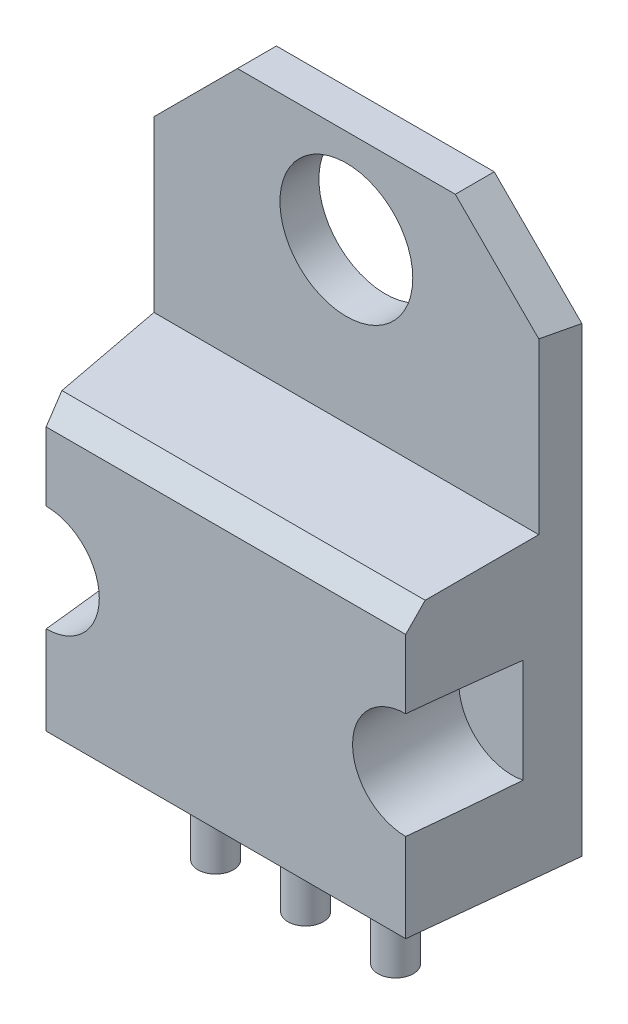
from build123d import *

# Parameters (mm, degrees)
ESQUISSE1_W             = 10.15
ESQUISSE1_H             = 15.5
EXTRUSION1_DEPTH        = 1.1
ESQUISSE2_R             = 1.875
ENL_V_MAT_EXTRU_1_DEPTH = 19.560239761
CHANFREIN1_SIZE         = 2
ESQUISSE3_W             = 10.15
ESQUISSE3_H             = 8
EXTRUSION2_DEPTH        = 3.4
ESQUISSE4_R             = 1.5
ENL_V_MAT_EXTRU_2_DEPTH = 3
D_POUILLE1_ANGLE        = 6
CHANFREIN2_SIZE         = 0.5
CHANFREIN2_SIZE2        = 0.561801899
ESQUISSE5_R             = 0.5
EXTRUSION3_DEPTH        = 3


with BuildPart() as part:
    # Esquisse1 → Extrusion1 (new body)
    with BuildSketch(Plane.XY):
        with Locations((5.075, 7.75)):
            Rectangle(ESQUISSE1_W, ESQUISSE1_H)
    extrude(amount=EXTRUSION1_DEPTH)

    # Esquisse2 → Enl_v. mat.-Extru.1 (cut, through all)
    with BuildSketch(Plane.XY.offset(1.1)):
        with Locations((5.075, 12.85)):
            Circle(ESQUISSE2_R)
    extrude(amount=-ENL_V_MAT_EXTRU_1_DEPTH, mode=Mode.SUBTRACT)

    # Chanfrein1
    chanfrein1_edges = [part.edges().sort_by_distance(p)[0] for p in [
        (0, 15.5, 0.55),
        (10.15, 15.5, 0.55),
    ]]
    chamfer(chanfrein1_edges, length=CHANFREIN1_SIZE)

    # Esquisse3 → Extrusion2 (add)
    with BuildSketch(Plane.XY.offset(1.1)):
        with Locations((5.075, 4)):
            Rectangle(ESQUISSE3_W, ESQUISSE3_H)
    extrude(amount=EXTRUSION2_DEPTH)

    # Esquisse4 → Enl_v. mat.-Extru.2 (cut)
    with BuildSketch(Plane.XY.offset(4.5)):
        with Locations((0, 4)):
            Circle(ESQUISSE4_R)
        with Locations((10.15, 4)):
            Circle(ESQUISSE4_R)
    extrude(amount=-ENL_V_MAT_EXTRU_2_DEPTH, mode=Mode.SUBTRACT)

    # D_pouille1
    d_pouille1_faces = [part.faces().sort_by_distance(p)[0] for p in [
        (10.15, 13.357697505, 0.55),
        (5.075, 8, 2.8),
        (0, 6.75, 0.142302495),
    ]]
    draft(d_pouille1_faces, Plane(origin=(0, 8, 4.5), x_dir=(1, 0, 0), z_dir=(0, 0, 1)), D_POUILLE1_ANGLE)

    # Chanfrein2
    chanfrein2_edges = [part.edges().sort_by_distance(p)[0] for p in [
        (5.075, 8, 4.5),
    ]]
    chanfrein2_side = [part.faces().sort_by_distance(p)[0] for p in [
        (5.075, 8.1807028, 2.780727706),
    ]]
    chamfer(chanfrein2_edges, length=CHANFREIN2_SIZE, length2=CHANFREIN2_SIZE2, reference=chanfrein2_side[0])

    # Esquisse5 → Extrusion3 (add)
    with BuildSketch(Plane.XZ):
        with Locations(Location((5.075, 2.25, 0), (0, 0, 90))):
            Circle(ESQUISSE5_R)
        with Locations(Location((7.615, 2.25, 0), (0, 0, 90))):
            Circle(ESQUISSE5_R)
        with Locations(Location((2.535, 2.25, 0), (0, 0, 90))):
            Circle(ESQUISSE5_R)
    extrude(amount=EXTRUSION3_DEPTH)


solid = part.part
